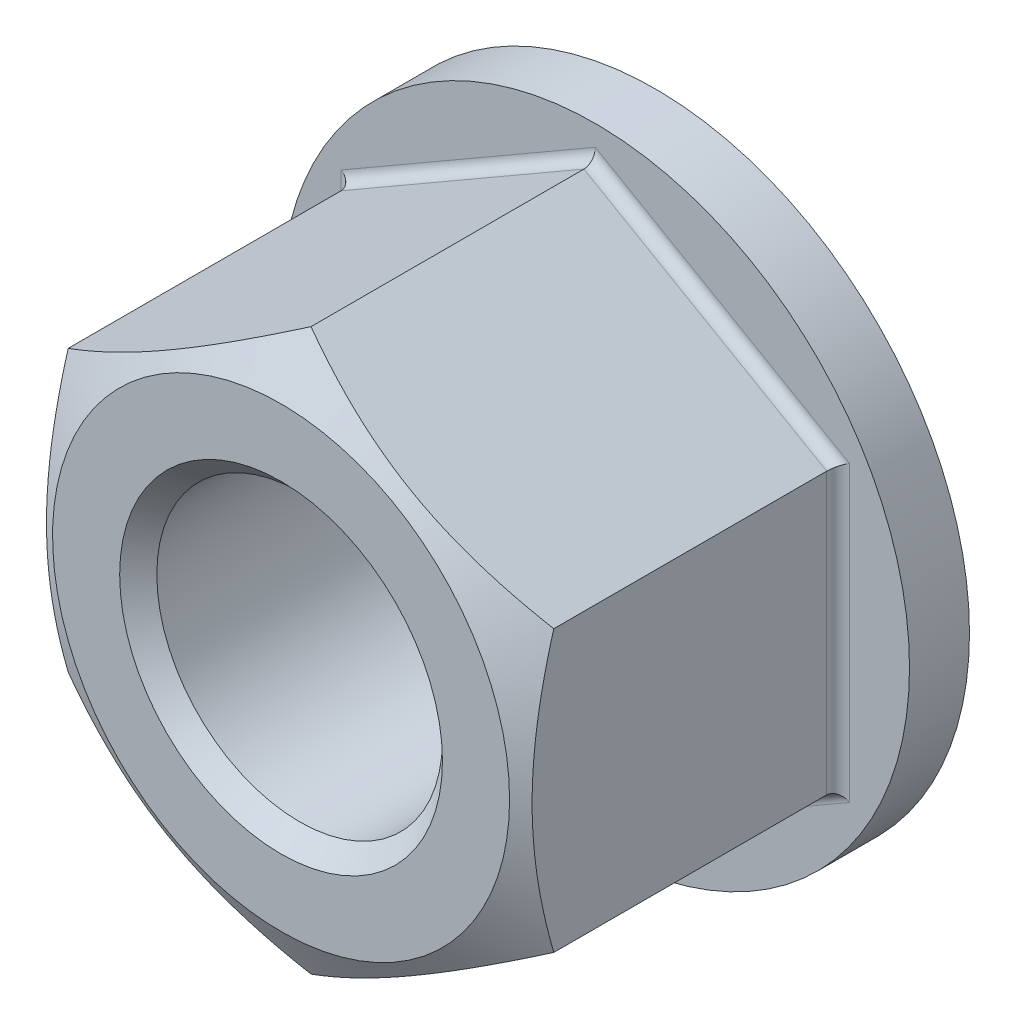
ISO-10303-21;
HEADER;
FILE_DESCRIPTION(('STEP AP214'),'2;1');
FILE_NAME('part.step','',(''),(''),'','','');
FILE_SCHEMA(('AUTOMOTIVE_DESIGN { 1 0 10303 214 1 1 1 1 }'));
ENDSEC;
DATA;
#1=APPLICATION_CONTEXT('core data for automotive mechanical design processes');
#2=APPLICATION_PROTOCOL_DEFINITION('international standard','automotive_design',2000,#1);
#3=PRODUCT_CONTEXT('',#1,'mechanical');
#4=PRODUCT('Part','Part','',(#3));
#5=PRODUCT_RELATED_PRODUCT_CATEGORY('part','',(#4));
#6=PRODUCT_DEFINITION_FORMATION('','',#4);
#7=PRODUCT_DEFINITION_CONTEXT('part definition',#1,'design');
#8=PRODUCT_DEFINITION('design','',#6,#7);
#9=PRODUCT_DEFINITION_SHAPE('','',#8);
#10=(LENGTH_UNIT() NAMED_UNIT(*) SI_UNIT(.MILLI.,.METRE.));
#11=(NAMED_UNIT(*) PLANE_ANGLE_UNIT() SI_UNIT($,.RADIAN.));
#12=(NAMED_UNIT(*) SI_UNIT($,.STERADIAN.) SOLID_ANGLE_UNIT());
#13=UNCERTAINTY_MEASURE_WITH_UNIT(LENGTH_MEASURE(1.E-05),#10,'distance_accuracy_value','');
#14=(GEOMETRIC_REPRESENTATION_CONTEXT(3) GLOBAL_UNCERTAINTY_ASSIGNED_CONTEXT((#13)) GLOBAL_UNIT_ASSIGNED_CONTEXT((#10,
#11,#12)) REPRESENTATION_CONTEXT('',''));
#15=CARTESIAN_POINT('',(0.,0.,0.));
#16=DIRECTION('',(0.,0.,1.));
#17=DIRECTION('',(1.,0.,0.));
#18=AXIS2_PLACEMENT_3D('',#15,#16,#17);
#19=CARTESIAN_POINT('',(-11.,0.,15.));
#20=DIRECTION('',(0.,0.,-1.));
#21=DIRECTION('',(-1.,0.,0.));
#22=AXIS2_PLACEMENT_3D('',#19,#20,#21);
#23=PLANE('',#22);
#24=CARTESIAN_POINT('',(0.,0.,15.));
#25=DIRECTION('',(0.,0.,-1.));
#26=DIRECTION('',(-1.,0.,0.));
#27=AXIS2_PLACEMENT_3D('',#24,#25,#26);
#28=CIRCLE('',#27,5.65);
#29=CARTESIAN_POINT('',(-5.65,0.,15.));
#30=VERTEX_POINT('',#29);
#31=EDGE_CURVE('E242',#30,#30,#28,.T.);
#32=ORIENTED_EDGE('',*,*,#31,.T.);
#33=EDGE_LOOP('',(#32));
#34=FACE_BOUND('',#33,.T.);
#35=CARTESIAN_POINT('',(0.,0.,15.));
#36=DIRECTION('',(0.,0.,1.));
#37=DIRECTION('',(1.,0.,0.));
#38=AXIS2_PLACEMENT_3D('',#35,#36,#37);
#39=CIRCLE('',#38,8.);
#40=CARTESIAN_POINT('',(8.,0.,15.));
#41=VERTEX_POINT('',#40);
#42=EDGE_CURVE('E109',#41,#41,#39,.T.);
#43=ORIENTED_EDGE('',*,*,#42,.T.);
#44=EDGE_LOOP('',(#43));
#45=FACE_BOUND('',#44,.T.);
#46=ADVANCED_FACE('F14',(#34,#45),#23,.F.);
#47=CARTESIAN_POINT('',(-8.5,-4.90747728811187,4.));
#48=DIRECTION('',(-0.5,-0.86602540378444,0.));
#49=DIRECTION('',(0.86602540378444,-0.5,0.));
#50=AXIS2_PLACEMENT_3D('',#47,#48,#49);
#51=PLANE('',#50);
#52=DIRECTION('',(0.,0.,1.));
#53=VECTOR('',#52,1.);
#54=CARTESIAN_POINT('',(-8.5,-4.90747728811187,4.));
#55=LINE('',#54,#53);
#56=CARTESIAN_POINT('',(-8.5,-4.90747728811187,4.4));
#57=VERTEX_POINT('',#56);
#58=CARTESIAN_POINT('',(-8.5,-4.90747728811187,13.9521354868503));
#59=VERTEX_POINT('',#58);
#60=EDGE_CURVE('E177',#57,#59,#55,.T.);
#61=ORIENTED_EDGE('',*,*,#60,.F.);
#62=DIRECTION('',(0.866025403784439,-0.5,0.));
#63=VECTOR('',#62,1.);
#64=CARTESIAN_POINT('',(0.,-9.81495457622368,4.4));
#65=LINE('',#64,#63);
#66=CARTESIAN_POINT('',(0.,-9.81495457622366,4.4));
#67=VERTEX_POINT('',#66);
#68=EDGE_CURVE('E179',#57,#67,#65,.T.);
#69=ORIENTED_EDGE('',*,*,#68,.T.);
#70=DIRECTION('',(0.,0.,1.));
#71=VECTOR('',#70,1.);
#72=CARTESIAN_POINT('',(0.,-9.81495457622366,4.));
#73=LINE('',#72,#71);
#74=CARTESIAN_POINT('',(0.,-9.81495457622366,13.9521354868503));
#75=VERTEX_POINT('',#74);
#76=EDGE_CURVE('E91',#67,#75,#73,.T.);
#77=ORIENTED_EDGE('',*,*,#76,.T.);
#78=CARTESIAN_POINT('',(0.000200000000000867,-9.81507004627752,13.9520688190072));
#79=CARTESIAN_POINT('',(-0.186639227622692,-9.70719836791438,14.0143387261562));
#80=CARTESIAN_POINT('',(-0.374175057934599,-9.5989245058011,14.0737825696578));
#81=CARTESIAN_POINT('',(-0.750769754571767,-9.38149745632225,14.1862397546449));
#82=CARTESIAN_POINT('',(-0.939829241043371,-9.27234391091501,14.2392503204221));
#83=CARTESIAN_POINT('',(-1.5100347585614,-8.94313560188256,14.3875914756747));
#84=CARTESIAN_POINT('',(-1.89343164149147,-8.72178130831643,14.4719659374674));
#85=CARTESIAN_POINT('',(-2.46717766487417,-8.39052888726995,14.5709048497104));
#86=CARTESIAN_POINT('',(-2.65581276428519,-8.28162036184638,14.599089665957));
#87=CARTESIAN_POINT('',(-3.03393602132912,-8.06331079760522,14.646350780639));
#88=CARTESIAN_POINT('',(-3.22342410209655,-7.95390980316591,14.6654278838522));
#89=CARTESIAN_POINT('',(-3.60272652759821,-7.73491944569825,14.6939900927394));
#90=CARTESIAN_POINT('',(-3.79254025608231,-7.62533043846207,14.7034860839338));
#91=CARTESIAN_POINT('',(-4.1723430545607,-7.4060511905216,14.7126824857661));
#92=CARTESIAN_POINT('',(-4.36233211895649,-7.29636095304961,14.7123831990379));
#93=CARTESIAN_POINT('',(-4.71752301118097,-7.09129139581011,14.7026703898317));
#94=CARTESIAN_POINT('',(-4.88274990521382,-6.99589760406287,14.6944416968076));
#95=CARTESIAN_POINT('',(-5.21281671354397,-6.8053334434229,14.6707356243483));
#96=CARTESIAN_POINT('',(-5.37765660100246,-6.71016309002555,14.6552577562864));
#97=CARTESIAN_POINT('',(-5.87153810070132,-6.42502047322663,14.5983162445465));
#98=CARTESIAN_POINT('',(-6.19970550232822,-6.23555293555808,14.5463518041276));
#99=CARTESIAN_POINT('',(-6.85952142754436,-5.85460803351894,14.4164399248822));
#100=CARTESIAN_POINT('',(-7.19108574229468,-5.66317928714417,14.3379417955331));
#101=CARTESIAN_POINT('',(-7.84926989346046,-5.28317649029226,14.1597835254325));
#102=CARTESIAN_POINT('',(-8.17589815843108,-5.09459757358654,14.0601652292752));
#103=CARTESIAN_POINT('',(-8.5002,-4.90736181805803,13.9520688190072));
#104=B_SPLINE_CURVE_WITH_KNOTS('',3,(#78,#79,#80,#81,#82,#83,#84,#85,#86,#87,#88,#89,#90,#91,
#92,#93,#94,#95,#96,#97,#98,#99,#100,#101,#102,#103),.UNSPECIFIED.,.F.,.F.,(4,2,2,2,2,2,2,2,2,2,
2,2,4),(0.,0.673596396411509,1.34748239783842,2.69805431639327,3.35679995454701,
4.01548737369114,4.67342558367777,5.33134346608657,5.90409556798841,6.47688628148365,
7.62328361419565,8.79510569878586,9.96462743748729),.UNSPECIFIED.);
#105=EDGE_CURVE('E103',#75,#59,#104,.T.);
#106=ORIENTED_EDGE('',*,*,#105,.T.);
#107=EDGE_LOOP('',(#61,#69,#77,#106));
#108=FACE_BOUND('',#107,.T.);
#109=ADVANCED_FACE('F164',(#108),#51,.T.);
#110=CARTESIAN_POINT('',(-8.5,4.90747728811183,4.));
#111=DIRECTION('',(-1.,0.,0.));
#112=DIRECTION('',(0.,-1.,0.));
#113=AXIS2_PLACEMENT_3D('',#110,#111,#112);
#114=PLANE('',#113);
#115=DIRECTION('',(0.,0.,1.));
#116=VECTOR('',#115,1.);
#117=CARTESIAN_POINT('',(-8.5,4.90747728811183,4.));
#118=LINE('',#117,#116);
#119=CARTESIAN_POINT('',(-8.5,4.90747728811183,4.4));
#120=VERTEX_POINT('',#119);
#121=CARTESIAN_POINT('',(-8.5,4.90747728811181,13.9521354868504));
#122=VERTEX_POINT('',#121);
#123=EDGE_CURVE('E181',#120,#122,#118,.T.);
#124=ORIENTED_EDGE('',*,*,#123,.F.);
#125=DIRECTION('',(0.,-1.,0.));
#126=VECTOR('',#125,1.);
#127=CARTESIAN_POINT('',(-8.5,-4.90747728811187,4.4));
#128=LINE('',#127,#126);
#129=EDGE_CURVE('E193',#120,#57,#128,.T.);
#130=ORIENTED_EDGE('',*,*,#129,.T.);
#131=ORIENTED_EDGE('',*,*,#60,.T.);
#132=CARTESIAN_POINT('',(-8.5,-13.099343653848,10.6032081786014));
#133=CARTESIAN_POINT('',(-8.5,-12.7287713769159,10.7826346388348));
#134=CARTESIAN_POINT('',(-8.5,-12.3573394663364,10.9603165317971));
#135=CARTESIAN_POINT('',(-8.5,-11.6122988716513,11.3112082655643));
#136=CARTESIAN_POINT('',(-8.5,-11.2386898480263,11.4844173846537));
#137=CARTESIAN_POINT('',(-8.5,-10.4868726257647,11.8262698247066));
#138=CARTESIAN_POINT('',(-8.5,-10.1086504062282,11.9948824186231));
#139=CARTESIAN_POINT('',(-8.5,-9.34916856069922,12.3250956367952));
#140=CARTESIAN_POINT('',(-8.5,-8.96790908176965,12.486696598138));
#141=CARTESIAN_POINT('',(-8.5,-8.18977836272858,12.8059424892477));
#142=CARTESIAN_POINT('',(-8.5,-7.792791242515,12.9633065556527));
#143=CARTESIAN_POINT('',(-8.5,-6.99414306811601,13.2659231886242));
#144=CARTESIAN_POINT('',(-8.5,-6.59248149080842,13.4111743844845));
#145=CARTESIAN_POINT('',(-8.5,-5.78461940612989,13.6856909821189));
#146=CARTESIAN_POINT('',(-8.5,-5.3784302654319,13.8149894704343));
#147=CARTESIAN_POINT('',(-8.5,-4.56024135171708,14.0533991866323));
#148=CARTESIAN_POINT('',(-8.5,-4.14824347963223,14.1625168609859));
#149=CARTESIAN_POINT('',(-8.5,-3.32039661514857,14.3546929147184));
#150=CARTESIAN_POINT('',(-8.5,-2.90458047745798,14.4378889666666));
#151=CARTESIAN_POINT('',(-8.5,-2.27713690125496,14.5395971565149));
#152=CARTESIAN_POINT('',(-8.5,-2.06735312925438,14.5696536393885));
#153=CARTESIAN_POINT('',(-8.5,-1.64677124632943,14.6214799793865));
#154=CARTESIAN_POINT('',(-8.5,-1.43597323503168,14.6432506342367));
#155=CARTESIAN_POINT('',(-8.5,-1.01636279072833,14.6778027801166));
#156=CARTESIAN_POINT('',(-8.5,-0.807559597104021,14.6906960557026));
#157=CARTESIAN_POINT('',(-8.5,-0.389595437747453,14.707647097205));
#158=CARTESIAN_POINT('',(-8.5,-0.180434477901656,14.7117050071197));
#159=CARTESIAN_POINT('',(-8.5,0.237872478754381,14.7108887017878));
#160=CARTESIAN_POINT('',(-8.5,0.447018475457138,14.7060144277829));
#161=CARTESIAN_POINT('',(-8.5,0.864921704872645,14.6874514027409));
#162=CARTESIAN_POINT('',(-8.5,1.07367891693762,14.6737621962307));
#163=CARTESIAN_POINT('',(-8.5,1.57791279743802,14.6303379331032));
#164=CARTESIAN_POINT('',(-8.5,1.8730248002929,14.5962803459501));
#165=CARTESIAN_POINT('',(-8.5,2.46098992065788,14.512426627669));
#166=CARTESIAN_POINT('',(-8.5,2.75384271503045,14.4626282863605));
#167=CARTESIAN_POINT('',(-8.5,3.62871535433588,14.2922686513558));
#168=CARTESIAN_POINT('',(-8.5,4.20670940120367,14.1507758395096));
#169=CARTESIAN_POINT('',(-8.5,5.07087714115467,13.9062761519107));
#170=CARTESIAN_POINT('',(-8.5,5.36155430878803,13.8182785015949));
#171=CARTESIAN_POINT('',(-8.5,5.94008388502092,13.6333592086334));
#172=CARTESIAN_POINT('',(-8.5,6.22793627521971,13.5364375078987));
#173=CARTESIAN_POINT('',(-8.5,6.80091124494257,13.3352072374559));
#174=CARTESIAN_POINT('',(-8.5,7.08603473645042,13.2309012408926));
#175=CARTESIAN_POINT('',(-8.5,7.65393377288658,13.0161081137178));
#176=CARTESIAN_POINT('',(-8.5,7.93670934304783,12.9056210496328));
#177=CARTESIAN_POINT('',(-8.5,8.59476812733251,12.6415355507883));
#178=CARTESIAN_POINT('',(-8.5,8.9692386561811,12.4859159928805));
#179=CARTESIAN_POINT('',(-8.5,9.71508355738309,12.1674057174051));
#180=CARTESIAN_POINT('',(-8.5,10.086457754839,12.0045145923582));
#181=CARTESIAN_POINT('',(-8.5,10.8266754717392,11.6728932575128));
#182=CARTESIAN_POINT('',(-8.5,11.1955184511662,11.5041618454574));
#183=CARTESIAN_POINT('',(-8.5,11.9310124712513,11.1620169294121));
#184=CARTESIAN_POINT('',(-8.5,12.2976635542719,10.9886035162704));
#185=CARTESIAN_POINT('',(-8.5,13.0295089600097,10.637776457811));
#186=CARTESIAN_POINT('',(-8.5,13.394701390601,10.4603588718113));
#187=CARTESIAN_POINT('',(-8.5,14.1235364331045,10.1023655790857));
#188=CARTESIAN_POINT('',(-8.5,14.487179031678,9.92178984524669));
#189=CARTESIAN_POINT('',(-8.5,15.5760565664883,9.37619716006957));
#190=CARTESIAN_POINT('',(-8.5,16.2993324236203,9.00727066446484));
#191=CARTESIAN_POINT('',(-8.5,17.6831656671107,8.29247148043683));
#192=CARTESIAN_POINT('',(-8.5,18.3440224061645,7.94717579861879));
#193=CARTESIAN_POINT('',(-8.5,19.6632830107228,7.25188123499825));
#194=CARTESIAN_POINT('',(-8.5,20.3216867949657,6.90188219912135));
#195=CARTESIAN_POINT('',(-8.5,21.6350179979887,6.19912530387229));
#196=CARTESIAN_POINT('',(-8.5,22.2899499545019,5.84637591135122));
#197=CARTESIAN_POINT('',(-8.5,23.5982404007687,5.13805150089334));
#198=CARTESIAN_POINT('',(-8.5,24.2515989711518,4.78247663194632));
#199=CARTESIAN_POINT('',(-8.5,24.9043757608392,4.42584400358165));
#200=B_SPLINE_CURVE_WITH_KNOTS('',3,(#132,#133,#134,#135,#136,#137,#138,#139,#140,#141,#142,
#143,#144,#145,#146,#147,#148,#149,#150,#151,#152,#153,#154,#155,#156,#157,#158,#159,#160,#161,
#162,#163,#164,#165,#166,#167,#168,#169,#170,#171,#172,#173,#174,#175,#176,#177,#178,#179,#180,
#181,#182,#183,#184,#185,#186,#187,#188,#189,#190,#191,#192,#193,#194,#195,#196,#197,#198,#199),
.UNSPECIFIED.,.F.,.F.,(4,2,2,2,2,2,2,2,2,2,2,2,2,2,2,2,2,2,2,2,2,2,2,2,2,2,2,2,2,2,2,2,2,4),(0.,
1.2351911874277,2.47058045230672,3.71283594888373,4.95503165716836,6.2359950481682,
7.51710319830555,8.79550794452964,10.0735036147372,11.3445912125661,11.9802312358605,
12.6158100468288,13.2432315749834,13.8706428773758,14.4980583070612,15.1255061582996,
16.0162132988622,16.9070455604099,18.6897304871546,19.6007726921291,20.5118208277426,
21.4225530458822,22.3332754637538,23.5497297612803,24.7662523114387,25.9830267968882,
27.1997776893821,28.4177833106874,29.6357993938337,32.0715277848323,34.3083907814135,
36.5453272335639,38.7769811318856,41.0085181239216),.UNSPECIFIED.);
#201=EDGE_CURVE('E152',#59,#122,#200,.T.);
#202=ORIENTED_EDGE('',*,*,#201,.T.);
#203=EDGE_LOOP('',(#124,#130,#131,#202));
#204=FACE_BOUND('',#203,.T.);
#205=ADVANCED_FACE('F142',(#204),#114,.T.);
#206=CARTESIAN_POINT('',(0.,9.81495457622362,4.));
#207=DIRECTION('',(-0.5,0.86602540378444,0.));
#208=DIRECTION('',(-0.86602540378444,-0.5,0.));
#209=AXIS2_PLACEMENT_3D('',#206,#207,#208);
#210=PLANE('',#209);
#211=DIRECTION('',(0.,0.,1.));
#212=VECTOR('',#211,1.);
#213=CARTESIAN_POINT('',(0.,9.81495457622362,4.));
#214=LINE('',#213,#212);
#215=CARTESIAN_POINT('',(0.,9.81495457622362,4.4));
#216=VERTEX_POINT('',#215);
#217=CARTESIAN_POINT('',(0.,9.81495457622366,13.9521354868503));
#218=VERTEX_POINT('',#217);
#219=EDGE_CURVE('E264',#216,#218,#214,.T.);
#220=ORIENTED_EDGE('',*,*,#219,.F.);
#221=DIRECTION('',(-0.866025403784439,-0.5,0.));
#222=VECTOR('',#221,1.);
#223=CARTESIAN_POINT('',(-8.5,4.90747728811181,4.4));
#224=LINE('',#223,#222);
#225=EDGE_CURVE('E236',#216,#120,#224,.T.);
#226=ORIENTED_EDGE('',*,*,#225,.T.);
#227=ORIENTED_EDGE('',*,*,#123,.T.);
#228=CARTESIAN_POINT('',(-8.5002,4.90736181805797,13.9520688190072));
#229=CARTESIAN_POINT('',(-8.31336077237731,5.01523349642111,14.0143387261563));
#230=CARTESIAN_POINT('',(-8.1258249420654,5.12350735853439,14.0737825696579));
#231=CARTESIAN_POINT('',(-7.74923024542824,5.34093440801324,14.1862397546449));
#232=CARTESIAN_POINT('',(-7.56017075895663,5.45008795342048,14.2392503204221));
#233=CARTESIAN_POINT('',(-6.9899652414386,5.77929626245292,14.3875914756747));
#234=CARTESIAN_POINT('',(-6.60656835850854,6.00065055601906,14.4719659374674));
#235=CARTESIAN_POINT('',(-6.03282233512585,6.33190297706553,14.5709048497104));
#236=CARTESIAN_POINT('',(-5.84418723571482,6.4408115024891,14.599089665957));
#237=CARTESIAN_POINT('',(-5.4660639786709,6.65912106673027,14.646350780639));
#238=CARTESIAN_POINT('',(-5.27657589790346,6.76852206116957,14.6654278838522));
#239=CARTESIAN_POINT('',(-4.8972734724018,6.98751241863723,14.6939900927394));
#240=CARTESIAN_POINT('',(-4.70745974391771,7.09710142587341,14.7034860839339));
#241=CARTESIAN_POINT('',(-4.32765694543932,7.31638067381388,14.7126824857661));
#242=CARTESIAN_POINT('',(-4.13766788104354,7.42607091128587,14.7123831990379));
#243=CARTESIAN_POINT('',(-3.78247698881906,7.63114046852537,14.7026703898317));
#244=CARTESIAN_POINT('',(-3.61725009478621,7.72653426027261,14.6944416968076));
#245=CARTESIAN_POINT('',(-3.28718328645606,7.91709842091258,14.6707356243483));
#246=CARTESIAN_POINT('',(-3.12234339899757,8.01226877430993,14.6552577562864));
#247=CARTESIAN_POINT('',(-2.6284618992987,8.29741139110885,14.5983162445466));
#248=CARTESIAN_POINT('',(-2.3002944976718,8.4868789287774,14.5463518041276));
#249=CARTESIAN_POINT('',(-1.64047857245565,8.86782383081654,14.4164399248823));
#250=CARTESIAN_POINT('',(-1.30891425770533,9.05925257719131,14.3379417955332));
#251=CARTESIAN_POINT('',(-0.65073010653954,9.43925537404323,14.1597835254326));
#252=CARTESIAN_POINT('',(-0.324101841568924,9.62783429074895,14.0601652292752));
#253=CARTESIAN_POINT('',(0.000199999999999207,9.81507004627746,13.9520688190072));
#254=B_SPLINE_CURVE_WITH_KNOTS('',3,(#228,#229,#230,#231,#232,#233,#234,#235,#236,#237,#238,
#239,#240,#241,#242,#243,#244,#245,#246,#247,#248,#249,#250,#251,#252,#253),.UNSPECIFIED.,.F.,
.F.,(4,2,2,2,2,2,2,2,2,2,2,2,4),(0.,0.673596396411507,1.34748239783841,2.69805431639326,
3.35679995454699,4.01548737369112,4.67342558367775,5.33134346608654,5.90409556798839,
6.47688628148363,7.62328361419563,8.79510569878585,9.96462743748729),.UNSPECIFIED.);
#255=EDGE_CURVE('E111',#122,#218,#254,.T.);
#256=ORIENTED_EDGE('',*,*,#255,.T.);
#257=EDGE_LOOP('',(#220,#226,#227,#256));
#258=FACE_BOUND('',#257,.T.);
#259=ADVANCED_FACE('F137',(#258),#210,.T.);
#260=CARTESIAN_POINT('',(8.5,4.90747728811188,4.));
#261=DIRECTION('',(0.5,0.866025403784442,0.));
#262=DIRECTION('',(-0.866025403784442,0.5,0.));
#263=AXIS2_PLACEMENT_3D('',#260,#261,#262);
#264=PLANE('',#263);
#265=DIRECTION('',(0.,0.,1.));
#266=VECTOR('',#265,1.);
#267=CARTESIAN_POINT('',(8.5,4.90747728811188,4.));
#268=LINE('',#267,#266);
#269=CARTESIAN_POINT('',(8.5,4.90747728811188,4.4));
#270=VERTEX_POINT('',#269);
#271=CARTESIAN_POINT('',(8.5,4.90747728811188,13.9521354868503));
#272=VERTEX_POINT('',#271);
#273=EDGE_CURVE('E90',#270,#272,#268,.T.);
#274=ORIENTED_EDGE('',*,*,#273,.F.);
#275=DIRECTION('',(-0.866025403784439,0.5,0.));
#276=VECTOR('',#275,1.);
#277=CARTESIAN_POINT('',(0.,9.81495457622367,4.4));
#278=LINE('',#277,#276);
#279=EDGE_CURVE('E9',#270,#216,#278,.T.);
#280=ORIENTED_EDGE('',*,*,#279,.T.);
#281=ORIENTED_EDGE('',*,*,#219,.T.);
#282=CARTESIAN_POINT('',(-0.000199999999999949,9.81507004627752,13.9520688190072));
#283=CARTESIAN_POINT('',(0.186639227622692,9.70719836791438,14.0143387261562));
#284=CARTESIAN_POINT('',(0.374175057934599,9.5989245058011,14.0737825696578));
#285=CARTESIAN_POINT('',(0.750769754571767,9.38149745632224,14.1862397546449));
#286=CARTESIAN_POINT('',(0.939829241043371,9.27234391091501,14.2392503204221));
#287=CARTESIAN_POINT('',(1.5100347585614,8.94313560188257,14.3875914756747));
#288=CARTESIAN_POINT('',(1.89343164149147,8.72178130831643,14.4719659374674));
#289=CARTESIAN_POINT('',(2.46717766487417,8.39052888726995,14.5709048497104));
#290=CARTESIAN_POINT('',(2.6558127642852,8.28162036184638,14.599089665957));
#291=CARTESIAN_POINT('',(3.03393602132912,8.06331079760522,14.646350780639));
#292=CARTESIAN_POINT('',(3.22342410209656,7.95390980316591,14.6654278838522));
#293=CARTESIAN_POINT('',(3.60272652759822,7.73491944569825,14.6939900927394));
#294=CARTESIAN_POINT('',(3.79254025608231,7.62533043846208,14.7034860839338));
#295=CARTESIAN_POINT('',(4.1723430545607,7.4060511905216,14.7126824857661));
#296=CARTESIAN_POINT('',(4.36233211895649,7.29636095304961,14.7123831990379));
#297=CARTESIAN_POINT('',(4.71752301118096,7.09129139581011,14.7026703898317));
#298=CARTESIAN_POINT('',(4.88274990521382,6.99589760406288,14.6944416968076));
#299=CARTESIAN_POINT('',(5.21281671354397,6.8053334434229,14.6707356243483));
#300=CARTESIAN_POINT('',(5.37765660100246,6.71016309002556,14.6552577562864));
#301=CARTESIAN_POINT('',(5.87153810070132,6.42502047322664,14.5983162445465));
#302=CARTESIAN_POINT('',(6.19970550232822,6.23555293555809,14.5463518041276));
#303=CARTESIAN_POINT('',(6.85952142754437,5.85460803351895,14.4164399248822));
#304=CARTESIAN_POINT('',(7.19108574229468,5.66317928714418,14.3379417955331));
#305=CARTESIAN_POINT('',(7.84926989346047,5.28317649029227,14.1597835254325));
#306=CARTESIAN_POINT('',(8.17589815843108,5.09459757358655,14.0601652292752));
#307=CARTESIAN_POINT('',(8.5002,4.90736181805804,13.9520688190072));
#308=B_SPLINE_CURVE_WITH_KNOTS('',3,(#282,#283,#284,#285,#286,#287,#288,#289,#290,#291,#292,
#293,#294,#295,#296,#297,#298,#299,#300,#301,#302,#303,#304,#305,#306,#307),.UNSPECIFIED.,.F.,
.F.,(4,2,2,2,2,2,2,2,2,2,2,2,4),(0.,0.67359639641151,1.34748239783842,2.69805431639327,
3.35679995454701,4.01548737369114,4.67342558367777,5.33134346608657,5.90409556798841,
6.47688628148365,7.62328361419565,8.79510569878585,9.96462743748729),.UNSPECIFIED.);
#309=EDGE_CURVE('E108',#218,#272,#308,.T.);
#310=ORIENTED_EDGE('',*,*,#309,.T.);
#311=EDGE_LOOP('',(#274,#280,#281,#310));
#312=FACE_BOUND('',#311,.T.);
#313=ADVANCED_FACE('F132',(#312),#264,.T.);
#314=CARTESIAN_POINT('',(8.5,-4.90747728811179,4.));
#315=DIRECTION('',(1.,0.,0.));
#316=DIRECTION('',(0.,0.,-1.));
#317=AXIS2_PLACEMENT_3D('',#314,#315,#316);
#318=PLANE('',#317);
#319=DIRECTION('',(0.,0.,1.));
#320=VECTOR('',#319,1.);
#321=CARTESIAN_POINT('',(8.5,-4.90747728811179,4.));
#322=LINE('',#321,#320);
#323=CARTESIAN_POINT('',(8.5,-4.90747728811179,4.4));
#324=VERTEX_POINT('',#323);
#325=CARTESIAN_POINT('',(8.5,-4.90747728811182,13.9521354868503));
#326=VERTEX_POINT('',#325);
#327=EDGE_CURVE('E84',#324,#326,#322,.T.);
#328=ORIENTED_EDGE('',*,*,#327,.F.);
#329=DIRECTION('',(0.,1.,0.));
#330=VECTOR('',#329,1.);
#331=CARTESIAN_POINT('',(8.5,4.90747728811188,4.4));
#332=LINE('',#331,#330);
#333=EDGE_CURVE('E23',#324,#270,#332,.T.);
#334=ORIENTED_EDGE('',*,*,#333,.T.);
#335=ORIENTED_EDGE('',*,*,#273,.T.);
#336=CARTESIAN_POINT('',(8.5,-13.0993436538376,10.6032081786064));
#337=CARTESIAN_POINT('',(8.5,-12.7287713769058,10.7826346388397));
#338=CARTESIAN_POINT('',(8.5,-12.3573394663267,10.9603165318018));
#339=CARTESIAN_POINT('',(8.5,-11.6122988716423,11.3112082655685));
#340=CARTESIAN_POINT('',(8.5,-11.2386898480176,11.4844173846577));
#341=CARTESIAN_POINT('',(8.5,-10.4868726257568,11.8262698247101));
#342=CARTESIAN_POINT('',(8.5,-10.1086504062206,11.9948824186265));
#343=CARTESIAN_POINT('',(8.5,-9.34916856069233,12.3250956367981));
#344=CARTESIAN_POINT('',(8.5,-8.96790908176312,12.4866965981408));
#345=CARTESIAN_POINT('',(8.5,-8.18977836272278,12.80594248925));
#346=CARTESIAN_POINT('',(8.5,-7.79279124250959,12.9633065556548));
#347=CARTESIAN_POINT('',(8.5,-6.99414306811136,13.2659231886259));
#348=CARTESIAN_POINT('',(8.5,-6.59248149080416,13.411174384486));
#349=CARTESIAN_POINT('',(8.5,-5.78461940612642,13.68569098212));
#350=CARTESIAN_POINT('',(8.5,-5.37843026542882,13.8149894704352));
#351=CARTESIAN_POINT('',(8.5,-4.5602413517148,14.0533991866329));
#352=CARTESIAN_POINT('',(8.5,-4.14824347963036,14.1625168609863));
#353=CARTESIAN_POINT('',(8.5,-3.32039661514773,14.3546929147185));
#354=CARTESIAN_POINT('',(8.5,-2.90458047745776,14.4378889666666));
#355=CARTESIAN_POINT('',(8.5,-2.27713690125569,14.5395971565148));
#356=CARTESIAN_POINT('',(8.5,-2.06735312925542,14.5696536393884));
#357=CARTESIAN_POINT('',(8.5,-1.64677124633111,14.6214799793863));
#358=CARTESIAN_POINT('',(8.5,-1.43597323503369,14.6432506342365));
#359=CARTESIAN_POINT('',(8.5,-1.01636279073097,14.6778027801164));
#360=CARTESIAN_POINT('',(8.5,-0.807559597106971,14.6906960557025));
#361=CARTESIAN_POINT('',(8.5,-0.38959543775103,14.7076470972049));
#362=CARTESIAN_POINT('',(8.5,-0.180434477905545,14.7117050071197));
#363=CARTESIAN_POINT('',(8.5,0.237872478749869,14.7108887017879));
#364=CARTESIAN_POINT('',(8.5,0.447018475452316,14.7060144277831));
#365=CARTESIAN_POINT('',(8.5,0.864921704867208,14.6874514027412));
#366=CARTESIAN_POINT('',(8.5,1.07367891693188,14.6737621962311));
#367=CARTESIAN_POINT('',(8.5,1.5779127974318,14.6303379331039));
#368=CARTESIAN_POINT('',(8.5,1.8730248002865,14.5962803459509));
#369=CARTESIAN_POINT('',(8.5,2.46098992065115,14.5124266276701));
#370=CARTESIAN_POINT('',(8.5,2.75384271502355,14.4626282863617));
#371=CARTESIAN_POINT('',(8.5,3.62871535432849,14.2922686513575));
#372=CARTESIAN_POINT('',(8.5,4.20670940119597,14.1507758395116));
#373=CARTESIAN_POINT('',(8.5,5.0708771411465,13.9062761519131));
#374=CARTESIAN_POINT('',(8.5,5.3615543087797,13.8182785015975));
#375=CARTESIAN_POINT('',(8.5,5.94008388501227,13.6333592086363));
#376=CARTESIAN_POINT('',(8.5,6.2279362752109,13.5364375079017));
#377=CARTESIAN_POINT('',(8.5,6.80091124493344,13.3352072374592));
#378=CARTESIAN_POINT('',(8.5,7.08603473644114,13.230901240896));
#379=CARTESIAN_POINT('',(8.5,7.65393377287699,13.0161081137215));
#380=CARTESIAN_POINT('',(8.5,7.93670934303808,12.9056210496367));
#381=CARTESIAN_POINT('',(8.5,8.59476812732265,12.6415355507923));
#382=CARTESIAN_POINT('',(8.5,8.96923865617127,12.4859159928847));
#383=CARTESIAN_POINT('',(8.5,9.71508355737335,12.1674057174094));
#384=CARTESIAN_POINT('',(8.5,10.0864577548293,12.0045145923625));
#385=CARTESIAN_POINT('',(8.5,10.8266754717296,11.6728932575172));
#386=CARTESIAN_POINT('',(8.5,11.1955184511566,11.5041618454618));
#387=CARTESIAN_POINT('',(8.5,11.9310124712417,11.1620169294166));
#388=CARTESIAN_POINT('',(8.5,12.2976635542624,10.9886035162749));
#389=CARTESIAN_POINT('',(8.5,13.0295089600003,10.6377764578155));
#390=CARTESIAN_POINT('',(8.5,13.3947013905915,10.4603588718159));
#391=CARTESIAN_POINT('',(8.5,14.1235364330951,10.1023655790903));
#392=CARTESIAN_POINT('',(8.5,14.4871790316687,9.92178984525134));
#393=CARTESIAN_POINT('',(8.5,15.5760565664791,9.37619716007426));
#394=CARTESIAN_POINT('',(8.5,16.2993324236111,9.00727066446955));
#395=CARTESIAN_POINT('',(8.5,17.6831656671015,8.29247148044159));
#396=CARTESIAN_POINT('',(8.5,18.3440224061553,7.94717579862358));
#397=CARTESIAN_POINT('',(8.5,19.6632830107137,7.2518812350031));
#398=CARTESIAN_POINT('',(8.5,20.3216867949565,6.90188219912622));
#399=CARTESIAN_POINT('',(8.5,21.6350179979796,6.1991253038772));
#400=CARTESIAN_POINT('',(8.5,22.2899499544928,5.84637591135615));
#401=CARTESIAN_POINT('',(8.5,23.5982404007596,5.1380515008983));
#402=CARTESIAN_POINT('',(8.5,24.2515989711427,4.7824766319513));
#403=CARTESIAN_POINT('',(8.5,24.90437576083,4.42584400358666));
#404=B_SPLINE_CURVE_WITH_KNOTS('',3,(#336,#337,#338,#339,#340,#341,#342,#343,#344,#345,#346,
#347,#348,#349,#350,#351,#352,#353,#354,#355,#356,#357,#358,#359,#360,#361,#362,#363,#364,#365,
#366,#367,#368,#369,#370,#371,#372,#373,#374,#375,#376,#377,#378,#379,#380,#381,#382,#383,#384,
#385,#386,#387,#388,#389,#390,#391,#392,#393,#394,#395,#396,#397,#398,#399,#400,#401,#402,#403),
.UNSPECIFIED.,.F.,.F.,(4,2,2,2,2,2,2,2,2,2,2,2,2,2,2,2,2,2,2,2,2,2,2,2,2,2,2,2,2,2,2,2,2,4),(0.,
1.23519118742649,2.4705804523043,3.71283594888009,4.95503165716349,6.23599504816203,
7.51710319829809,8.79550794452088,10.0735036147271,11.3445912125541,11.9802312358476,
12.6158100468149,13.2432315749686,13.87064287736,14.4980583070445,15.125506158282,
16.016213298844,16.9070455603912,18.6897304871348,19.6007726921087,20.5118208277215,
21.4225530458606,22.3332754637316,23.5497297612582,24.7662523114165,25.9830267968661,
27.1997776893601,28.4177833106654,29.6357993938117,32.0715277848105,34.3083907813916,
36.545327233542,38.7769811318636,41.0085181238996),.UNSPECIFIED.);
#405=EDGE_CURVE('E99',#272,#326,#404,.F.);
#406=ORIENTED_EDGE('',*,*,#405,.T.);
#407=EDGE_LOOP('',(#328,#334,#335,#406));
#408=FACE_BOUND('',#407,.T.);
#409=ADVANCED_FACE('F107',(#408),#318,.T.);
#410=CARTESIAN_POINT('',(0.,-9.81495457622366,4.));
#411=DIRECTION('',(0.5,-0.866025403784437,0.));
#412=DIRECTION('',(0.866025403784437,0.5,0.));
#413=AXIS2_PLACEMENT_3D('',#410,#411,#412);
#414=PLANE('',#413);
#415=ORIENTED_EDGE('',*,*,#76,.F.);
#416=DIRECTION('',(0.866025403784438,0.5,0.));
#417=VECTOR('',#416,1.);
#418=CARTESIAN_POINT('',(8.5,-4.90747728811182,4.4));
#419=LINE('',#418,#417);
#420=EDGE_CURVE('E38',#67,#324,#419,.T.);
#421=ORIENTED_EDGE('',*,*,#420,.T.);
#422=ORIENTED_EDGE('',*,*,#327,.T.);
#423=CARTESIAN_POINT('',(8.5002,-4.90736181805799,13.9520688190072));
#424=CARTESIAN_POINT('',(8.31336077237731,-5.01523349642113,14.0143387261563));
#425=CARTESIAN_POINT('',(8.1258249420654,-5.12350735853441,14.0737825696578));
#426=CARTESIAN_POINT('',(7.74923024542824,-5.34093440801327,14.1862397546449));
#427=CARTESIAN_POINT('',(7.56017075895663,-5.4500879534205,14.2392503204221));
#428=CARTESIAN_POINT('',(6.9899652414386,-5.77929626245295,14.3875914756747));
#429=CARTESIAN_POINT('',(6.60656835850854,-6.00065055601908,14.4719659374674));
#430=CARTESIAN_POINT('',(6.03282233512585,-6.33190297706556,14.5709048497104));
#431=CARTESIAN_POINT('',(5.84418723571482,-6.44081150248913,14.599089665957));
#432=CARTESIAN_POINT('',(5.4660639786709,-6.65912106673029,14.646350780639));
#433=CARTESIAN_POINT('',(5.27657589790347,-6.7685220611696,14.6654278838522));
#434=CARTESIAN_POINT('',(4.89727347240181,-6.98751241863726,14.6939900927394));
#435=CARTESIAN_POINT('',(4.70745974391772,-7.09710142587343,14.7034860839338));
#436=CARTESIAN_POINT('',(4.32765694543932,-7.31638067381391,14.7126824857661));
#437=CARTESIAN_POINT('',(4.13766788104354,-7.4260709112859,14.7123831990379));
#438=CARTESIAN_POINT('',(3.78247698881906,-7.6311404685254,14.7026703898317));
#439=CARTESIAN_POINT('',(3.61725009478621,-7.72653426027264,14.6944416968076));
#440=CARTESIAN_POINT('',(3.28718328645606,-7.91709842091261,14.6707356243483));
#441=CARTESIAN_POINT('',(3.12234339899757,-8.01226877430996,14.6552577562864));
#442=CARTESIAN_POINT('',(2.6284618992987,-8.29741139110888,14.5983162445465));
#443=CARTESIAN_POINT('',(2.30029449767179,-8.48687892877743,14.5463518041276));
#444=CARTESIAN_POINT('',(1.64047857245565,-8.86782383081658,14.4164399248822));
#445=CARTESIAN_POINT('',(1.30891425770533,-9.05925257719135,14.3379417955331));
#446=CARTESIAN_POINT('',(0.650730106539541,-9.43925537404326,14.1597835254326));
#447=CARTESIAN_POINT('',(0.324101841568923,-9.62783429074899,14.0601652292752));
#448=CARTESIAN_POINT('',(-0.000199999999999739,-9.8150700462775,13.9520688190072));
#449=B_SPLINE_CURVE_WITH_KNOTS('',3,(#423,#424,#425,#426,#427,#428,#429,#430,#431,#432,#433,
#434,#435,#436,#437,#438,#439,#440,#441,#442,#443,#444,#445,#446,#447,#448),.UNSPECIFIED.,.F.,
.F.,(4,2,2,2,2,2,2,2,2,2,2,2,4),(0.,0.673596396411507,1.34748239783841,2.69805431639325,
3.35679995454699,4.01548737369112,4.67342558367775,5.33134346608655,5.90409556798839,
6.47688628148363,7.62328361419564,8.79510569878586,9.9646274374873),.UNSPECIFIED.);
#450=EDGE_CURVE('E87',#326,#75,#449,.T.);
#451=ORIENTED_EDGE('',*,*,#450,.T.);
#452=EDGE_LOOP('',(#415,#421,#422,#451));
#453=FACE_BOUND('',#452,.T.);
#454=ADVANCED_FACE('F86',(#453),#414,.T.);
#455=CARTESIAN_POINT('',(0.,0.,30.));
#456=DIRECTION('',(0.,0.,1.));
#457=DIRECTION('',(1.,0.,0.));
#458=AXIS2_PLACEMENT_3D('',#455,#456,#457);
#459=CYLINDRICAL_SURFACE('',#458,11.);
#460=CARTESIAN_POINT('',(0.,0.,1.9));
#461=DIRECTION('',(0.,0.,1.));
#462=DIRECTION('',(1.,0.,0.));
#463=AXIS2_PLACEMENT_3D('',#460,#461,#462);
#464=CIRCLE('',#463,11.);
#465=CARTESIAN_POINT('',(11.,0.,1.9));
#466=VERTEX_POINT('',#465);
#467=EDGE_CURVE('E255',#466,#466,#464,.T.);
#468=ORIENTED_EDGE('',*,*,#467,.T.);
#469=EDGE_LOOP('',(#468));
#470=FACE_BOUND('',#469,.T.);
#471=CARTESIAN_POINT('',(0.,0.,4.));
#472=DIRECTION('',(0.,0.,1.));
#473=DIRECTION('',(1.,0.,0.));
#474=AXIS2_PLACEMENT_3D('',#471,#472,#473);
#475=CIRCLE('',#474,11.);
#476=CARTESIAN_POINT('',(11.,0.,4.));
#477=VERTEX_POINT('',#476);
#478=EDGE_CURVE('E180',#477,#477,#475,.T.);
#479=ORIENTED_EDGE('',*,*,#478,.F.);
#480=EDGE_LOOP('',(#479));
#481=FACE_BOUND('',#480,.T.);
#482=ADVANCED_FACE('F376',(#470,#481),#459,.T.);
#483=CARTESIAN_POINT('',(0.,0.,30.));
#484=DIRECTION('',(0.,0.,1.));
#485=DIRECTION('',(1.,0.,0.));
#486=AXIS2_PLACEMENT_3D('',#483,#484,#485);
#487=CYLINDRICAL_SURFACE('',#486,5.);
#488=CARTESIAN_POINT('',(0.,0.,14.35));
#489=DIRECTION('',(0.,0.,-1.));
#490=DIRECTION('',(-1.,0.,0.));
#491=AXIS2_PLACEMENT_3D('',#488,#489,#490);
#492=CIRCLE('',#491,5.);
#493=CARTESIAN_POINT('',(-5.,0.,14.35));
#494=VERTEX_POINT('',#493);
#495=EDGE_CURVE('E104',#494,#494,#492,.F.);
#496=ORIENTED_EDGE('',*,*,#495,.T.);
#497=EDGE_LOOP('',(#496));
#498=FACE_BOUND('',#497,.T.);
#499=CARTESIAN_POINT('',(0.,0.,0.));
#500=DIRECTION('',(0.,0.,1.));
#501=DIRECTION('',(1.,0.,0.));
#502=AXIS2_PLACEMENT_3D('',#499,#500,#501);
#503=CIRCLE('',#502,5.);
#504=CARTESIAN_POINT('',(5.,0.,0.));
#505=VERTEX_POINT('',#504);
#506=EDGE_CURVE('E105',#505,#505,#503,.T.);
#507=ORIENTED_EDGE('',*,*,#506,.F.);
#508=EDGE_LOOP('',(#507));
#509=FACE_BOUND('',#508,.T.);
#510=ADVANCED_FACE('F366',(#498,#509),#487,.F.);
#511=CARTESIAN_POINT('',(-5.,0.,0.));
#512=DIRECTION('',(0.,0.,1.));
#513=DIRECTION('',(1.,0.,0.));
#514=AXIS2_PLACEMENT_3D('',#511,#512,#513);
#515=PLANE('',#514);
#516=CARTESIAN_POINT('',(0.,0.,0.));
#517=DIRECTION('',(0.,0.,1.));
#518=DIRECTION('',(1.,0.,0.));
#519=AXIS2_PLACEMENT_3D('',#516,#517,#518);
#520=CIRCLE('',#519,5.66393958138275);
#521=CARTESIAN_POINT('',(5.66393958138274,0.,0.));
#522=VERTEX_POINT('',#521);
#523=EDGE_CURVE('E258',#522,#522,#520,.T.);
#524=ORIENTED_EDGE('',*,*,#523,.F.);
#525=EDGE_LOOP('',(#524));
#526=FACE_BOUND('',#525,.T.);
#527=ORIENTED_EDGE('',*,*,#506,.T.);
#528=EDGE_LOOP('',(#527));
#529=FACE_BOUND('',#528,.T.);
#530=ADVANCED_FACE('F356',(#526,#529),#515,.F.);
#531=CARTESIAN_POINT('',(0.,0.,24.3499443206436));
#532=DIRECTION('',(0.,0.,1.));
#533=DIRECTION('',(1.,0.,0.));
#534=AXIS2_PLACEMENT_3D('',#531,#532,#533);
#535=SPHERICAL_SURFACE('',#534,25.);
#536=CARTESIAN_POINT('',(11.,0.,1.9));
#537=CARTESIAN_POINT('',(10.9469019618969,0.,1.87398307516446));
#538=CARTESIAN_POINT('',(10.8937116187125,0.,1.84815453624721));
#539=CARTESIAN_POINT('',(10.787149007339,0.,1.7968755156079));
#540=CARTESIAN_POINT('',(10.7337767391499,0.,1.77142503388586));
#541=CARTESIAN_POINT('',(10.6268529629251,0.,1.72090341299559));
#542=CARTESIAN_POINT('',(10.5733014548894,0.,1.69583227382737));
#543=CARTESIAN_POINT('',(10.4660218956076,0.,1.64607059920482));
#544=CARTESIAN_POINT('',(10.4122938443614,0.,1.62138006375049));
#545=CARTESIAN_POINT('',(10.3046639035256,0.,1.57238083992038));
#546=CARTESIAN_POINT('',(10.250762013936,0.,1.5480721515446));
#547=CARTESIAN_POINT('',(10.1427871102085,0.,1.49983784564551));
#548=CARTESIAN_POINT('',(10.0887140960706,0.,1.4759122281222));
#549=CARTESIAN_POINT('',(9.98039966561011,0.,1.4284452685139));
#550=CARTESIAN_POINT('',(9.92615824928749,0.,1.40490392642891));
#551=CARTESIAN_POINT('',(9.81750974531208,0.,1.35820670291));
#552=CARTESIAN_POINT('',(9.7631026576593,0.,1.33505082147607));
#553=CARTESIAN_POINT('',(9.65412555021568,0.,1.28912568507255));
#554=CARTESIAN_POINT('',(9.59955553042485,0.,1.26635643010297));
#555=CARTESIAN_POINT('',(9.49025530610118,0.,1.22120569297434));
#556=CARTESIAN_POINT('',(9.43552510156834,0.,1.1988242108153));
#557=CARTESIAN_POINT('',(9.32590726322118,0.,1.15445014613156));
#558=CARTESIAN_POINT('',(9.27101962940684,0.,1.13245756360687));
#559=CARTESIAN_POINT('',(9.16108969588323,0.,1.08886240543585));
#560=CARTESIAN_POINT('',(9.10604739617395,0.,1.06725982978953));
#561=CARTESIAN_POINT('',(8.9958109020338,0.,1.02444577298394));
#562=CARTESIAN_POINT('',(8.94061670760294,0.,1.00323429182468));
#563=CARTESIAN_POINT('',(8.83007920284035,0.,0.961203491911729));
#564=CARTESIAN_POINT('',(8.77473589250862,0.,0.940384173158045));
#565=CARTESIAN_POINT('',(8.66390294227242,0.,0.899138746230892));
#566=CARTESIAN_POINT('',(8.60841330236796,0.,0.878712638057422));
#567=CARTESIAN_POINT('',(8.49729048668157,0.,0.838254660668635));
#568=CARTESIAN_POINT('',(8.44165731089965,0.,0.818222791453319));
#569=CARTESIAN_POINT('',(8.33025022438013,0.,0.778554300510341));
#570=CARTESIAN_POINT('',(8.27447631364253,0.,0.75891767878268));
#571=CARTESIAN_POINT('',(8.16279056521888,0.,0.720040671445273));
#572=CARTESIAN_POINT('',(8.10687872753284,0.,0.700800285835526));
#573=CARTESIAN_POINT('',(7.99491994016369,0.,0.662716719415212));
#574=CARTESIAN_POINT('',(7.93887299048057,0.,0.643873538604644));
#575=CARTESIAN_POINT('',(7.82664680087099,0.,0.606585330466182));
#576=CARTESIAN_POINT('',(7.77046756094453,0.,0.588140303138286));
#577=CARTESIAN_POINT('',(7.65797961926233,0.,0.551649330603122));
#578=CARTESIAN_POINT('',(7.60167091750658,0.,0.533603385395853));
#579=CARTESIAN_POINT('',(7.48892688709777,0.,0.497911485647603));
#580=CARTESIAN_POINT('',(7.4324915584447,0.,0.480265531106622));
#581=CARTESIAN_POINT('',(7.31949711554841,0.,0.445374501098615));
#582=CARTESIAN_POINT('',(7.26293800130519,0.,0.42812942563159));
#583=CARTESIAN_POINT('',(7.14969883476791,0.,0.394041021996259));
#584=CARTESIAN_POINT('',(7.09301878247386,0.,0.377197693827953));
#585=CARTESIAN_POINT('',(6.97954059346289,0.,0.343913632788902));
#586=CARTESIAN_POINT('',(6.92274245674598,0.,0.327472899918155));
#587=CARTESIAN_POINT('',(6.80903095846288,0.,0.294994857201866));
#588=CARTESIAN_POINT('',(6.75211759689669,0.,0.278957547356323));
#589=CARTESIAN_POINT('',(6.6381785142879,0.,0.247287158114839));
#590=CARTESIAN_POINT('',(6.58115279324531,0.,0.231654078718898));
#591=CARTESIAN_POINT('',(6.46699186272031,0.,0.200792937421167));
#592=CARTESIAN_POINT('',(6.4098566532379,0.,0.185564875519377));
#593=CARTESIAN_POINT('',(6.29547962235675,0.,0.155514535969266));
#594=CARTESIAN_POINT('',(6.238237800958,0.,0.140692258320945));
#595=CARTESIAN_POINT('',(6.12365042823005,0.,0.111454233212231));
#596=CARTESIAN_POINT('',(6.06630487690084,0.,0.0970384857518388));
#597=CARTESIAN_POINT('',(5.95151293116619,0.,0.068614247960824));
#598=CARTESIAN_POINT('',(5.89406653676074,0.,0.0546057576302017));
#599=CARTESIAN_POINT('',(5.77907579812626,0.,0.0269967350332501));
#600=CARTESIAN_POINT('',(5.72153145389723,0.,0.0133962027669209));
#601=CARTESIAN_POINT('',(5.66393958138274,0.,0.));
#602=B_SPLINE_CURVE_WITH_KNOTS('',3,(#536,#537,#538,#539,#540,#541,#542,#543,#544,#545,#546,
#547,#548,#549,#550,#551,#552,#553,#554,#555,#556,#557,#558,#559,#560,#561,#562,#563,#564,#565,
#566,#567,#568,#569,#570,#571,#572,#573,#574,#575,#576,#577,#578,#579,#580,#581,#582,#583,#584,
#585,#586,#587,#588,#589,#590,#591,#592,#593,#594,#595,#596,#597,#598,#599,#600,#601),
.UNSPECIFIED.,.F.,.F.,(4,2,2,2,2,2,2,2,2,2,2,2,2,2,2,2,2,2,2,2,2,2,2,2,2,2,2,2,2,2,2,2,4),(0.,
0.177387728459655,0.354775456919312,0.532163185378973,0.709550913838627,0.886938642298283,
1.06432637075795,1.2417140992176,1.41910182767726,1.59648955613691,1.77387728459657,
1.95126501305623,2.12865274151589,2.30604046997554,2.4834281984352,2.66081592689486,
2.83820365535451,3.01559138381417,3.19297911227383,3.37036684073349,3.54775456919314,
3.7251422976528,3.90253002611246,4.07991775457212,4.25730548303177,4.43469321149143,
4.61208093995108,4.78946866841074,4.9668563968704,5.14424412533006,5.32163185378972,
5.49901958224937,5.67640731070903),.UNSPECIFIED.);
#603=EDGE_CURVE('BSEAM348',#466,#522,#602,.T.);
#604=ORIENTED_EDGE('',*,*,#467,.F.);
#605=ORIENTED_EDGE('',*,*,#523,.T.);
#606=ORIENTED_EDGE('',*,*,#603,.T.);
#607=ORIENTED_EDGE('',*,*,#603,.F.);
#608=EDGE_LOOP('',(#604,#606,#605,#607));
#609=FACE_BOUND('',#608,.T.);
#610=ADVANCED_FACE('F348',(#609),#535,.T.);
#611=CARTESIAN_POINT('',(0.,0.,4.));
#612=DIRECTION('',(0.,0.,1.));
#613=DIRECTION('',(1.,0.,0.));
#614=AXIS2_PLACEMENT_3D('',#611,#612,#613);
#615=PLANE('',#614);
#616=DIRECTION('',(0.,-1.,0.));
#617=VECTOR('',#616,1.);
#618=CARTESIAN_POINT('',(-8.9,4.90747728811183,4.));
#619=LINE('',#618,#617);
#620=CARTESIAN_POINT('',(-8.9,-5.13841739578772,4.));
#621=VERTEX_POINT('',#620);
#622=CARTESIAN_POINT('',(-8.9,5.13841739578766,4.));
#623=VERTEX_POINT('',#622);
#624=EDGE_CURVE('E200',#621,#623,#619,.F.);
#625=ORIENTED_EDGE('',*,*,#624,.T.);
#626=DIRECTION('',(-0.866025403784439,-0.5,0.));
#627=VECTOR('',#626,1.);
#628=CARTESIAN_POINT('',(-0.2,10.1613647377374,4.));
#629=LINE('',#628,#627);
#630=CARTESIAN_POINT('',(0.,10.2768347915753,4.));
#631=VERTEX_POINT('',#630);
#632=EDGE_CURVE('E227',#623,#631,#629,.F.);
#633=ORIENTED_EDGE('',*,*,#632,.T.);
#634=DIRECTION('',(-0.866025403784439,0.5,0.));
#635=VECTOR('',#634,1.);
#636=CARTESIAN_POINT('',(8.7,5.25388744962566,4.));
#637=LINE('',#636,#635);
#638=CARTESIAN_POINT('',(8.9,5.13841739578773,4.));
#639=VERTEX_POINT('',#638);
#640=EDGE_CURVE('E222',#631,#639,#637,.F.);
#641=ORIENTED_EDGE('',*,*,#640,.T.);
#642=DIRECTION('',(0.,1.,0.));
#643=VECTOR('',#642,1.);
#644=CARTESIAN_POINT('',(8.9,-4.90747728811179,4.));
#645=LINE('',#644,#643);
#646=CARTESIAN_POINT('',(8.9,-5.13841739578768,4.));
#647=VERTEX_POINT('',#646);
#648=EDGE_CURVE('E214',#639,#647,#645,.F.);
#649=ORIENTED_EDGE('',*,*,#648,.T.);
#650=DIRECTION('',(0.866025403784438,0.5,0.));
#651=VECTOR('',#650,1.);
#652=CARTESIAN_POINT('',(0.2,-10.1613647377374,4.));
#653=LINE('',#652,#651);
#654=CARTESIAN_POINT('',(0.,-10.2768347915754,4.));
#655=VERTEX_POINT('',#654);
#656=EDGE_CURVE('E217',#647,#655,#653,.F.);
#657=ORIENTED_EDGE('',*,*,#656,.T.);
#658=DIRECTION('',(0.866025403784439,-0.5,0.));
#659=VECTOR('',#658,1.);
#660=CARTESIAN_POINT('',(-8.7,-5.25388744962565,4.));
#661=LINE('',#660,#659);
#662=EDGE_CURVE('E219',#655,#621,#661,.F.);
#663=ORIENTED_EDGE('',*,*,#662,.T.);
#664=EDGE_LOOP('',(#625,#633,#641,#649,#657,#663));
#665=FACE_BOUND('',#664,.T.);
#666=ORIENTED_EDGE('',*,*,#478,.T.);
#667=EDGE_LOOP('',(#666));
#668=FACE_BOUND('',#667,.T.);
#669=ADVANCED_FACE('F239',(#665,#668),#615,.T.);
#670=CARTESIAN_POINT('',(0.,0.,15.));
#671=DIRECTION('',(0.,0.,-1.));
#672=DIRECTION('',(-1.,0.,0.));
#673=AXIS2_PLACEMENT_3D('',#670,#671,#672);
#674=CONICAL_SURFACE('',#673,8.,1.0471975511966);
#675=ORIENTED_EDGE('',*,*,#450,.F.);
#676=ORIENTED_EDGE('',*,*,#405,.F.);
#677=ORIENTED_EDGE('',*,*,#309,.F.);
#678=ORIENTED_EDGE('',*,*,#255,.F.);
#679=ORIENTED_EDGE('',*,*,#201,.F.);
#680=ORIENTED_EDGE('',*,*,#105,.F.);
#681=EDGE_LOOP('',(#675,#676,#677,#678,#679,#680));
#682=FACE_BOUND('',#681,.T.);
#683=ORIENTED_EDGE('',*,*,#42,.F.);
#684=EDGE_LOOP('',(#683));
#685=FACE_BOUND('',#684,.T.);
#686=ADVANCED_FACE('F96',(#682,#685),#674,.T.);
#687=CARTESIAN_POINT('',(0.,0.,14.35));
#688=DIRECTION('',(0.,0.,1.));
#689=DIRECTION('',(1.,0.,0.));
#690=AXIS2_PLACEMENT_3D('',#687,#688,#689);
#691=CONICAL_SURFACE('',#690,5.,0.785398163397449);
#692=ORIENTED_EDGE('',*,*,#31,.F.);
#693=EDGE_LOOP('',(#692));
#694=FACE_BOUND('',#693,.T.);
#695=ORIENTED_EDGE('',*,*,#495,.F.);
#696=EDGE_LOOP('',(#695));
#697=FACE_BOUND('',#696,.T.);
#698=ADVANCED_FACE('F284',(#694,#697),#691,.F.);
#699=CARTESIAN_POINT('',(0.2,-10.1613647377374,4.4));
#700=DIRECTION('',(-0.866025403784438,-0.5,0.));
#701=DIRECTION('',(0.5,-0.866025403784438,0.));
#702=AXIS2_PLACEMENT_3D('',#699,#700,#701);
#703=CYLINDRICAL_SURFACE('',#702,0.4);
#704=CARTESIAN_POINT('',(0.,-10.2768347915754,4.4));
#705=DIRECTION('',(-1.,0.,0.));
#706=DIRECTION('',(0.,-1.,0.));
#707=AXIS2_PLACEMENT_3D('',#704,#705,#706);
#708=ELLIPSE('',#707,0.461880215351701,0.4);
#709=EDGE_CURVE('E192',#655,#67,#708,.F.);
#710=ORIENTED_EDGE('',*,*,#709,.F.);
#711=ORIENTED_EDGE('',*,*,#656,.F.);
#712=CARTESIAN_POINT('',(8.9,-5.13841739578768,4.4));
#713=DIRECTION('',(-0.5,-0.866025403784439,0.));
#714=DIRECTION('',(0.866025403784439,-0.5,0.));
#715=AXIS2_PLACEMENT_3D('',#712,#713,#714);
#716=ELLIPSE('',#715,0.461880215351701,0.4);
#717=EDGE_CURVE('E18',#324,#647,#716,.T.);
#718=ORIENTED_EDGE('',*,*,#717,.F.);
#719=ORIENTED_EDGE('',*,*,#420,.F.);
#720=EDGE_LOOP('',(#710,#711,#718,#719));
#721=FACE_BOUND('',#720,.T.);
#722=ADVANCED_FACE('F16',(#721),#703,.F.);
#723=CARTESIAN_POINT('',(8.9,-4.90747728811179,4.4));
#724=DIRECTION('',(0.,-1.,0.));
#725=DIRECTION('',(0.,0.,-1.));
#726=AXIS2_PLACEMENT_3D('',#723,#724,#725);
#727=CYLINDRICAL_SURFACE('',#726,0.4);
#728=ORIENTED_EDGE('',*,*,#717,.T.);
#729=ORIENTED_EDGE('',*,*,#648,.F.);
#730=CARTESIAN_POINT('',(8.9,5.13841739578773,4.4));
#731=DIRECTION('',(0.5,-0.866025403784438,0.));
#732=DIRECTION('',(0.866025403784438,0.5,0.));
#733=AXIS2_PLACEMENT_3D('',#730,#731,#732);
#734=ELLIPSE('',#733,0.461880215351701,0.4);
#735=EDGE_CURVE('E201',#270,#639,#734,.T.);
#736=ORIENTED_EDGE('',*,*,#735,.F.);
#737=ORIENTED_EDGE('',*,*,#333,.F.);
#738=EDGE_LOOP('',(#728,#729,#736,#737));
#739=FACE_BOUND('',#738,.T.);
#740=ADVANCED_FACE('F212',(#739),#727,.F.);
#741=CARTESIAN_POINT('',(-8.7,-5.25388744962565,4.4));
#742=DIRECTION('',(-0.866025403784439,0.5,0.));
#743=DIRECTION('',(-0.5,-0.866025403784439,0.));
#744=AXIS2_PLACEMENT_3D('',#741,#742,#743);
#745=CYLINDRICAL_SURFACE('',#744,0.4);
#746=ORIENTED_EDGE('',*,*,#709,.T.);
#747=ORIENTED_EDGE('',*,*,#68,.F.);
#748=CARTESIAN_POINT('',(-8.9,-5.13841739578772,4.4));
#749=DIRECTION('',(-0.5,0.866025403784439,0.));
#750=DIRECTION('',(-0.866025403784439,-0.5,0.));
#751=AXIS2_PLACEMENT_3D('',#748,#749,#750);
#752=ELLIPSE('',#751,0.461880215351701,0.4);
#753=EDGE_CURVE('E189',#621,#57,#752,.F.);
#754=ORIENTED_EDGE('',*,*,#753,.F.);
#755=ORIENTED_EDGE('',*,*,#662,.F.);
#756=EDGE_LOOP('',(#746,#747,#754,#755));
#757=FACE_BOUND('',#756,.T.);
#758=ADVANCED_FACE('F187',(#757),#745,.F.);
#759=CARTESIAN_POINT('',(8.7,5.25388744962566,4.4));
#760=DIRECTION('',(0.866025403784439,-0.5,0.));
#761=DIRECTION('',(0.5,0.86602540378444,0.));
#762=AXIS2_PLACEMENT_3D('',#759,#760,#761);
#763=CYLINDRICAL_SURFACE('',#762,0.4);
#764=ORIENTED_EDGE('',*,*,#735,.T.);
#765=ORIENTED_EDGE('',*,*,#640,.F.);
#766=CARTESIAN_POINT('',(0.,10.2768347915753,4.4));
#767=DIRECTION('',(1.,0.,0.));
#768=DIRECTION('',(0.,-1.,0.));
#769=AXIS2_PLACEMENT_3D('',#766,#767,#768);
#770=ELLIPSE('',#769,0.4618802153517,0.4);
#771=EDGE_CURVE('E202',#216,#631,#770,.T.);
#772=ORIENTED_EDGE('',*,*,#771,.F.);
#773=ORIENTED_EDGE('',*,*,#279,.F.);
#774=EDGE_LOOP('',(#764,#765,#772,#773));
#775=FACE_BOUND('',#774,.T.);
#776=ADVANCED_FACE('F270',(#775),#763,.F.);
#777=CARTESIAN_POINT('',(-8.9,4.90747728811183,4.4));
#778=DIRECTION('',(0.,1.,0.));
#779=DIRECTION('',(-1.,0.,0.));
#780=AXIS2_PLACEMENT_3D('',#777,#778,#779);
#781=CYLINDRICAL_SURFACE('',#780,0.4);
#782=ORIENTED_EDGE('',*,*,#753,.T.);
#783=ORIENTED_EDGE('',*,*,#129,.F.);
#784=CARTESIAN_POINT('',(-8.9,5.13841739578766,4.4));
#785=DIRECTION('',(0.5,0.866025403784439,0.));
#786=DIRECTION('',(-0.866025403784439,0.5,0.));
#787=AXIS2_PLACEMENT_3D('',#784,#785,#786);
#788=ELLIPSE('',#787,0.461880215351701,0.4);
#789=EDGE_CURVE('E206',#623,#120,#788,.F.);
#790=ORIENTED_EDGE('',*,*,#789,.F.);
#791=ORIENTED_EDGE('',*,*,#624,.F.);
#792=EDGE_LOOP('',(#782,#783,#790,#791));
#793=FACE_BOUND('',#792,.T.);
#794=ADVANCED_FACE('F197',(#793),#781,.F.);
#795=CARTESIAN_POINT('',(-0.2,10.1613647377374,4.4));
#796=DIRECTION('',(0.866025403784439,0.5,0.));
#797=DIRECTION('',(-0.5,0.866025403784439,0.));
#798=AXIS2_PLACEMENT_3D('',#795,#796,#797);
#799=CYLINDRICAL_SURFACE('',#798,0.4);
#800=ORIENTED_EDGE('',*,*,#771,.T.);
#801=ORIENTED_EDGE('',*,*,#632,.F.);
#802=ORIENTED_EDGE('',*,*,#789,.T.);
#803=ORIENTED_EDGE('',*,*,#225,.F.);
#804=EDGE_LOOP('',(#800,#801,#802,#803));
#805=FACE_BOUND('',#804,.T.);
#806=ADVANCED_FACE('F235',(#805),#799,.F.);
#807=CLOSED_SHELL('',(#46,#109,#205,#259,#313,#409,#454,#482,#510,#530,#610,#669,#686,#698,#722,
#740,#758,#776,#794,#806));
#808=MANIFOLD_SOLID_BREP('B1',#807);
#809=ADVANCED_BREP_SHAPE_REPRESENTATION('',(#18,#808),#14);
#810=SHAPE_DEFINITION_REPRESENTATION(#9,#809);
ENDSEC;
END-ISO-10303-21;
